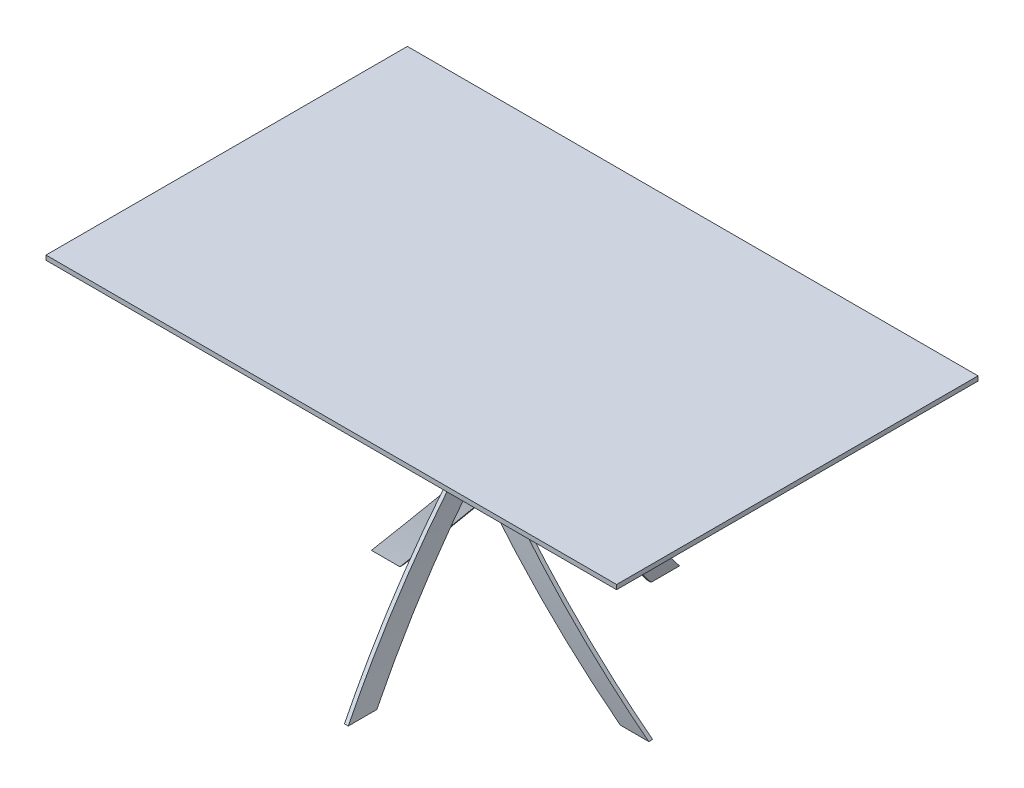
ISO-10303-21;
HEADER;
FILE_DESCRIPTION(('STEP AP214'),'2;1');
FILE_NAME('part.step','',(''),(''),'','','');
FILE_SCHEMA(('AUTOMOTIVE_DESIGN { 1 0 10303 214 1 1 1 1 }'));
ENDSEC;
DATA;
#1=APPLICATION_CONTEXT('core data for automotive mechanical design processes');
#2=APPLICATION_PROTOCOL_DEFINITION('international standard','automotive_design',2000,#1);
#3=PRODUCT_CONTEXT('',#1,'mechanical');
#4=PRODUCT('Part','Part','',(#3));
#5=PRODUCT_RELATED_PRODUCT_CATEGORY('part','',(#4));
#6=PRODUCT_DEFINITION_FORMATION('','',#4);
#7=PRODUCT_DEFINITION_CONTEXT('part definition',#1,'design');
#8=PRODUCT_DEFINITION('design','',#6,#7);
#9=PRODUCT_DEFINITION_SHAPE('','',#8);
#10=(LENGTH_UNIT() NAMED_UNIT(*) SI_UNIT(.MILLI.,.METRE.));
#11=(NAMED_UNIT(*) PLANE_ANGLE_UNIT() SI_UNIT($,.RADIAN.));
#12=(NAMED_UNIT(*) SI_UNIT($,.STERADIAN.) SOLID_ANGLE_UNIT());
#13=UNCERTAINTY_MEASURE_WITH_UNIT(LENGTH_MEASURE(1.E-05),#10,'distance_accuracy_value','');
#14=(GEOMETRIC_REPRESENTATION_CONTEXT(3) GLOBAL_UNCERTAINTY_ASSIGNED_CONTEXT((#13)) GLOBAL_UNIT_ASSIGNED_CONTEXT((#10,
#11,#12)) REPRESENTATION_CONTEXT('',''));
#15=CARTESIAN_POINT('',(0.,0.,0.));
#16=DIRECTION('',(0.,0.,1.));
#17=DIRECTION('',(1.,0.,0.));
#18=AXIS2_PLACEMENT_3D('',#15,#16,#17);
#19=CARTESIAN_POINT('',(1721.56180703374,370.,500.000000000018));
#20=DIRECTION('',(0.,0.,-1.));
#21=DIRECTION('',(-1.,0.,0.));
#22=AXIS2_PLACEMENT_3D('',#19,#20,#21);
#23=CYLINDRICAL_SURFACE('',#22,1800.);
#24=DIRECTION('',(0.,0.,-1.));
#25=VECTOR('',#24,1.);
#26=CARTESIAN_POINT('',(-40.4188966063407,1.99999999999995,499.999999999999));
#27=LINE('',#26,#25);
#28=CARTESIAN_POINT('',(-40.4188966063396,1.99999999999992,399.994999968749));
#29=VERTEX_POINT('',#28);
#30=CARTESIAN_POINT('',(-40.418896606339,1.99999999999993,324.994999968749));
#31=VERTEX_POINT('',#30);
#32=EDGE_CURVE('E70',#29,#31,#27,.T.);
#33=ORIENTED_EDGE('',*,*,#32,.F.);
#34=CARTESIAN_POINT('',(1721.56180703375,370.,100.808008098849));
#35=DIRECTION('',(0.,0.63083008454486,0.775921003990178));
#36=DIRECTION('',(0.,0.775921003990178,-0.63083008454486));
#37=AXIS2_PLACEMENT_3D('',#34,#35,#36);
#38=ELLIPSE('',#37,2319.82378456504,1800.);
#39=CARTESIAN_POINT('',(-39.9999999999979,740.,-200.005000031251));
#40=VERTEX_POINT('',#39);
#41=EDGE_CURVE('E90',#40,#29,#38,.T.);
#42=ORIENTED_EDGE('',*,*,#41,.F.);
#43=CARTESIAN_POINT('',(1721.56180703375,370.,-200.005000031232));
#44=DIRECTION('',(0.,0.,-1.));
#45=DIRECTION('',(-1.,0.,0.));
#46=AXIS2_PLACEMENT_3D('',#43,#44,#45);
#47=CIRCLE('',#46,1800.);
#48=CARTESIAN_POINT('',(-56.8799090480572,647.75,-200.005000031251));
#49=VERTEX_POINT('',#48);
#50=EDGE_CURVE('E87',#49,#40,#47,.T.);
#51=ORIENTED_EDGE('',*,*,#50,.F.);
#52=CARTESIAN_POINT('',(1721.56180703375,370.,25.808008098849));
#53=DIRECTION('',(0.,-0.63083008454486,-0.775921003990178));
#54=DIRECTION('',(0.,0.775921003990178,-0.63083008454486));
#55=AXIS2_PLACEMENT_3D('',#52,#53,#54);
#56=ELLIPSE('',#55,2319.82378456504,1800.);
#57=EDGE_CURVE('E50',#31,#49,#56,.T.);
#58=ORIENTED_EDGE('',*,*,#57,.F.);
#59=EDGE_LOOP('',(#33,#42,#51,#58));
#60=FACE_BOUND('',#59,.T.);
#61=ADVANCED_FACE('F46',(#60),#23,.T.);
#62=CARTESIAN_POINT('',(-300.000000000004,1.99999999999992,399.994999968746));
#63=DIRECTION('',(0.,0.63083008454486,0.775921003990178));
#64=DIRECTION('',(0.,-0.775921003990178,0.63083008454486));
#65=AXIS2_PLACEMENT_3D('',#62,#63,#64);
#66=PLANE('',#65);
#67=DIRECTION('',(1.,0.,0.));
#68=VECTOR('',#67,1.);
#69=CARTESIAN_POINT('',(-299.999999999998,740.,-200.005000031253));
#70=LINE('',#69,#68);
#71=CARTESIAN_POINT('',(-29.9999999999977,740.,-200.005000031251));
#72=VERTEX_POINT('',#71);
#73=EDGE_CURVE('E110',#40,#72,#70,.T.);
#74=ORIENTED_EDGE('',*,*,#73,.F.);
#75=ORIENTED_EDGE('',*,*,#41,.T.);
#76=DIRECTION('',(1.,0.,0.));
#77=VECTOR('',#76,1.);
#78=CARTESIAN_POINT('',(-300.000000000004,1.99999999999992,399.994999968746));
#79=LINE('',#78,#77);
#80=CARTESIAN_POINT('',(-30.4188966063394,1.99999999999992,399.994999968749));
#81=VERTEX_POINT('',#80);
#82=EDGE_CURVE('E104',#29,#81,#79,.T.);
#83=ORIENTED_EDGE('',*,*,#82,.T.);
#84=CARTESIAN_POINT('',(1731.56180703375,370.,100.808008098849));
#85=DIRECTION('',(0.,0.63083008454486,0.775921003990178));
#86=DIRECTION('',(0.,0.775921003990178,-0.63083008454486));
#87=AXIS2_PLACEMENT_3D('',#84,#85,#86);
#88=ELLIPSE('',#87,2319.82378456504,1800.);
#89=EDGE_CURVE('E95',#81,#72,#88,.F.);
#90=ORIENTED_EDGE('',*,*,#89,.T.);
#91=EDGE_LOOP('',(#74,#75,#83,#90));
#92=FACE_BOUND('',#91,.T.);
#93=ADVANCED_FACE('F119',(#92),#66,.T.);
#94=CARTESIAN_POINT('',(-299.999999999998,647.75,-200.005000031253));
#95=DIRECTION('',(0.,-0.63083008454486,-0.775921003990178));
#96=DIRECTION('',(0.,0.775921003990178,-0.63083008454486));
#97=AXIS2_PLACEMENT_3D('',#94,#95,#96);
#98=PLANE('',#97);
#99=DIRECTION('',(1.,0.,0.));
#100=VECTOR('',#99,1.);
#101=CARTESIAN_POINT('',(-300.000000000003,1.99999999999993,324.994999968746));
#102=LINE('',#101,#100);
#103=CARTESIAN_POINT('',(-30.4188966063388,1.99999999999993,324.994999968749));
#104=VERTEX_POINT('',#103);
#105=EDGE_CURVE('E12',#31,#104,#102,.T.);
#106=ORIENTED_EDGE('',*,*,#105,.F.);
#107=ORIENTED_EDGE('',*,*,#57,.T.);
#108=DIRECTION('',(1.,0.,0.));
#109=VECTOR('',#108,1.);
#110=CARTESIAN_POINT('',(-299.999999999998,647.75,-200.005000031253));
#111=LINE('',#110,#109);
#112=CARTESIAN_POINT('',(-46.879909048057,647.75,-200.005000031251));
#113=VERTEX_POINT('',#112);
#114=EDGE_CURVE('E55',#49,#113,#111,.T.);
#115=ORIENTED_EDGE('',*,*,#114,.T.);
#116=CARTESIAN_POINT('',(1731.56180703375,370.,25.8080080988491));
#117=DIRECTION('',(0.,-0.63083008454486,-0.775921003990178));
#118=DIRECTION('',(0.,0.775921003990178,-0.63083008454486));
#119=AXIS2_PLACEMENT_3D('',#116,#117,#118);
#120=ELLIPSE('',#119,2319.82378456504,1800.);
#121=EDGE_CURVE('E100',#113,#104,#120,.F.);
#122=ORIENTED_EDGE('',*,*,#121,.T.);
#123=EDGE_LOOP('',(#106,#107,#115,#122));
#124=FACE_BOUND('',#123,.T.);
#125=ADVANCED_FACE('F48',(#124),#98,.T.);
#126=CARTESIAN_POINT('',(-300.000000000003,1.99999999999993,324.994999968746));
#127=DIRECTION('',(0.,-1.,0.));
#128=DIRECTION('',(0.,0.,-1.));
#129=AXIS2_PLACEMENT_3D('',#126,#127,#128);
#130=PLANE('',#129);
#131=ORIENTED_EDGE('',*,*,#82,.F.);
#132=ORIENTED_EDGE('',*,*,#32,.T.);
#133=ORIENTED_EDGE('',*,*,#105,.T.);
#134=DIRECTION('',(0.,0.,-1.));
#135=VECTOR('',#134,1.);
#136=CARTESIAN_POINT('',(-30.4188966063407,1.99999999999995,500.));
#137=LINE('',#136,#135);
#138=EDGE_CURVE('E62',#104,#81,#137,.F.);
#139=ORIENTED_EDGE('',*,*,#138,.T.);
#140=EDGE_LOOP('',(#131,#132,#133,#139));
#141=FACE_BOUND('',#140,.T.);
#142=ADVANCED_FACE('F118',(#141),#130,.T.);
#143=CARTESIAN_POINT('',(-299.999999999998,740.,-200.005000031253));
#144=DIRECTION('',(0.,0.,-1.));
#145=DIRECTION('',(-1.,0.,0.));
#146=AXIS2_PLACEMENT_3D('',#143,#144,#145);
#147=PLANE('',#146);
#148=ORIENTED_EDGE('',*,*,#114,.F.);
#149=ORIENTED_EDGE('',*,*,#50,.T.);
#150=ORIENTED_EDGE('',*,*,#73,.T.);
#151=CARTESIAN_POINT('',(1731.56180703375,370.,-200.005000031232));
#152=DIRECTION('',(0.,0.,-1.));
#153=DIRECTION('',(-1.,0.,0.));
#154=AXIS2_PLACEMENT_3D('',#151,#152,#153);
#155=CIRCLE('',#154,1800.);
#156=EDGE_CURVE('E96',#72,#113,#155,.F.);
#157=ORIENTED_EDGE('',*,*,#156,.T.);
#158=EDGE_LOOP('',(#148,#149,#150,#157));
#159=FACE_BOUND('',#158,.T.);
#160=ADVANCED_FACE('F101',(#159),#147,.T.);
#161=CARTESIAN_POINT('',(1731.56180703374,370.,500.000000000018));
#162=DIRECTION('',(0.,0.,-1.));
#163=DIRECTION('',(-1.,0.,0.));
#164=AXIS2_PLACEMENT_3D('',#161,#162,#163);
#165=CYLINDRICAL_SURFACE('',#164,1800.);
#166=ORIENTED_EDGE('',*,*,#138,.F.);
#167=ORIENTED_EDGE('',*,*,#121,.F.);
#168=ORIENTED_EDGE('',*,*,#156,.F.);
#169=ORIENTED_EDGE('',*,*,#89,.F.);
#170=EDGE_LOOP('',(#166,#167,#168,#169));
#171=FACE_BOUND('',#170,.T.);
#172=ADVANCED_FACE('F122',(#171),#165,.F.);
#173=CLOSED_SHELL('',(#61,#93,#125,#142,#160,#172));
#174=MANIFOLD_SOLID_BREP('B2',#173);
#175=CARTESIAN_POINT('',(500.,370.,-1721.56180703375));
#176=DIRECTION('',(-1.,0.,0.));
#177=DIRECTION('',(0.,0.,1.));
#178=AXIS2_PLACEMENT_3D('',#175,#176,#177);
#179=CYLINDRICAL_SURFACE('',#178,1800.);
#180=DIRECTION('',(-1.,0.,0.));
#181=VECTOR('',#180,1.);
#182=CARTESIAN_POINT('',(500.,1.99999999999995,40.4188966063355));
#183=LINE('',#182,#181);
#184=CARTESIAN_POINT('',(399.99499996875,1.99999999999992,40.4188966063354));
#185=VERTEX_POINT('',#184);
#186=CARTESIAN_POINT('',(324.99499996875,1.99999999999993,40.4188966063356));
#187=VERTEX_POINT('',#186);
#188=EDGE_CURVE('E216',#185,#187,#183,.T.);
#189=ORIENTED_EDGE('',*,*,#188,.F.);
#190=CARTESIAN_POINT('',(100.808008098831,370.,-1721.56180703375));
#191=DIRECTION('',(0.775921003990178,0.63083008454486,0.));
#192=DIRECTION('',(-0.63083008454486,0.775921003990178,0.));
#193=AXIS2_PLACEMENT_3D('',#190,#191,#192);
#194=ELLIPSE('',#193,2319.82378456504,1800.);
#195=CARTESIAN_POINT('',(-200.00500003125,740.,40.));
#196=VERTEX_POINT('',#195);
#197=EDGE_CURVE('E236',#196,#185,#194,.T.);
#198=ORIENTED_EDGE('',*,*,#197,.F.);
#199=CARTESIAN_POINT('',(-200.00500003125,370.,-1721.56180703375));
#200=DIRECTION('',(-1.,0.,0.));
#201=DIRECTION('',(0.,0.,1.));
#202=AXIS2_PLACEMENT_3D('',#199,#200,#201);
#203=CIRCLE('',#202,1800.);
#204=CARTESIAN_POINT('',(-200.00500003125,647.75,56.8799090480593));
#205=VERTEX_POINT('',#204);
#206=EDGE_CURVE('E233',#205,#196,#203,.T.);
#207=ORIENTED_EDGE('',*,*,#206,.F.);
#208=CARTESIAN_POINT('',(25.808008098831,370.,-1721.56180703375));
#209=DIRECTION('',(-0.775921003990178,-0.63083008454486,0.));
#210=DIRECTION('',(-0.63083008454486,0.775921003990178,0.));
#211=AXIS2_PLACEMENT_3D('',#208,#209,#210);
#212=ELLIPSE('',#211,2319.82378456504,1800.);
#213=EDGE_CURVE('E196',#187,#205,#212,.T.);
#214=ORIENTED_EDGE('',*,*,#213,.F.);
#215=EDGE_LOOP('',(#189,#198,#207,#214));
#216=FACE_BOUND('',#215,.T.);
#217=ADVANCED_FACE('F192',(#216),#179,.T.);
#218=CARTESIAN_POINT('',(399.99499996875,1.99999999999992,300.));
#219=DIRECTION('',(0.775921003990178,0.63083008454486,0.));
#220=DIRECTION('',(0.63083008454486,-0.775921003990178,0.));
#221=AXIS2_PLACEMENT_3D('',#218,#219,#220);
#222=PLANE('',#221);
#223=DIRECTION('',(0.,0.,-1.));
#224=VECTOR('',#223,1.);
#225=CARTESIAN_POINT('',(-200.00500003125,740.,300.));
#226=LINE('',#225,#224);
#227=CARTESIAN_POINT('',(-200.00500003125,740.,29.9999999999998));
#228=VERTEX_POINT('',#227);
#229=EDGE_CURVE('E256',#196,#228,#226,.T.);
#230=ORIENTED_EDGE('',*,*,#229,.F.);
#231=ORIENTED_EDGE('',*,*,#197,.T.);
#232=DIRECTION('',(0.,0.,-1.));
#233=VECTOR('',#232,1.);
#234=CARTESIAN_POINT('',(399.99499996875,1.99999999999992,300.));
#235=LINE('',#234,#233);
#236=CARTESIAN_POINT('',(399.99499996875,1.99999999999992,30.4188966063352));
#237=VERTEX_POINT('',#236);
#238=EDGE_CURVE('E250',#185,#237,#235,.T.);
#239=ORIENTED_EDGE('',*,*,#238,.T.);
#240=CARTESIAN_POINT('',(100.808008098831,370.,-1731.56180703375));
#241=DIRECTION('',(0.775921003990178,0.63083008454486,0.));
#242=DIRECTION('',(-0.63083008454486,0.775921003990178,0.));
#243=AXIS2_PLACEMENT_3D('',#240,#241,#242);
#244=ELLIPSE('',#243,2319.82378456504,1800.);
#245=EDGE_CURVE('E241',#237,#228,#244,.F.);
#246=ORIENTED_EDGE('',*,*,#245,.T.);
#247=EDGE_LOOP('',(#230,#231,#239,#246));
#248=FACE_BOUND('',#247,.T.);
#249=ADVANCED_FACE('F265',(#248),#222,.T.);
#250=CARTESIAN_POINT('',(-200.00500003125,647.75,300.));
#251=DIRECTION('',(-0.775921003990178,-0.63083008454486,0.));
#252=DIRECTION('',(-0.63083008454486,0.775921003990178,0.));
#253=AXIS2_PLACEMENT_3D('',#250,#251,#252);
#254=PLANE('',#253);
#255=DIRECTION('',(0.,0.,-1.));
#256=VECTOR('',#255,1.);
#257=CARTESIAN_POINT('',(324.99499996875,1.99999999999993,300.));
#258=LINE('',#257,#256);
#259=CARTESIAN_POINT('',(324.99499996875,1.99999999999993,30.4188966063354));
#260=VERTEX_POINT('',#259);
#261=EDGE_CURVE('E44',#187,#260,#258,.T.);
#262=ORIENTED_EDGE('',*,*,#261,.F.);
#263=ORIENTED_EDGE('',*,*,#213,.T.);
#264=DIRECTION('',(0.,0.,-1.));
#265=VECTOR('',#264,1.);
#266=CARTESIAN_POINT('',(-200.00500003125,647.75,300.));
#267=LINE('',#266,#265);
#268=CARTESIAN_POINT('',(-200.00500003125,647.75,46.8799090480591));
#269=VERTEX_POINT('',#268);
#270=EDGE_CURVE('E201',#205,#269,#267,.T.);
#271=ORIENTED_EDGE('',*,*,#270,.T.);
#272=CARTESIAN_POINT('',(25.808008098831,370.,-1731.56180703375));
#273=DIRECTION('',(-0.775921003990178,-0.63083008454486,0.));
#274=DIRECTION('',(-0.63083008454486,0.775921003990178,0.));
#275=AXIS2_PLACEMENT_3D('',#272,#273,#274);
#276=ELLIPSE('',#275,2319.82378456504,1800.);
#277=EDGE_CURVE('E246',#269,#260,#276,.F.);
#278=ORIENTED_EDGE('',*,*,#277,.T.);
#279=EDGE_LOOP('',(#262,#263,#271,#278));
#280=FACE_BOUND('',#279,.T.);
#281=ADVANCED_FACE('F194',(#280),#254,.T.);
#282=CARTESIAN_POINT('',(324.99499996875,1.99999999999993,300.));
#283=DIRECTION('',(0.,-1.,0.));
#284=DIRECTION('',(-1.,0.,0.));
#285=AXIS2_PLACEMENT_3D('',#282,#283,#284);
#286=PLANE('',#285);
#287=ORIENTED_EDGE('',*,*,#238,.F.);
#288=ORIENTED_EDGE('',*,*,#188,.T.);
#289=ORIENTED_EDGE('',*,*,#261,.T.);
#290=DIRECTION('',(-1.,0.,0.));
#291=VECTOR('',#290,1.);
#292=CARTESIAN_POINT('',(500.,1.99999999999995,30.4188966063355));
#293=LINE('',#292,#291);
#294=EDGE_CURVE('E208',#260,#237,#293,.F.);
#295=ORIENTED_EDGE('',*,*,#294,.T.);
#296=EDGE_LOOP('',(#287,#288,#289,#295));
#297=FACE_BOUND('',#296,.T.);
#298=ADVANCED_FACE('F264',(#297),#286,.T.);
#299=CARTESIAN_POINT('',(-200.00500003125,740.,300.));
#300=DIRECTION('',(-1.,0.,0.));
#301=DIRECTION('',(0.,0.,1.));
#302=AXIS2_PLACEMENT_3D('',#299,#300,#301);
#303=PLANE('',#302);
#304=ORIENTED_EDGE('',*,*,#270,.F.);
#305=ORIENTED_EDGE('',*,*,#206,.T.);
#306=ORIENTED_EDGE('',*,*,#229,.T.);
#307=CARTESIAN_POINT('',(-200.00500003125,370.,-1731.56180703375));
#308=DIRECTION('',(-1.,0.,0.));
#309=DIRECTION('',(0.,0.,1.));
#310=AXIS2_PLACEMENT_3D('',#307,#308,#309);
#311=CIRCLE('',#310,1800.);
#312=EDGE_CURVE('E242',#228,#269,#311,.F.);
#313=ORIENTED_EDGE('',*,*,#312,.T.);
#314=EDGE_LOOP('',(#304,#305,#306,#313));
#315=FACE_BOUND('',#314,.T.);
#316=ADVANCED_FACE('F247',(#315),#303,.T.);
#317=CARTESIAN_POINT('',(500.,370.,-1731.56180703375));
#318=DIRECTION('',(-1.,0.,0.));
#319=DIRECTION('',(0.,0.,1.));
#320=AXIS2_PLACEMENT_3D('',#317,#318,#319);
#321=CYLINDRICAL_SURFACE('',#320,1800.);
#322=ORIENTED_EDGE('',*,*,#294,.F.);
#323=ORIENTED_EDGE('',*,*,#277,.F.);
#324=ORIENTED_EDGE('',*,*,#312,.F.);
#325=ORIENTED_EDGE('',*,*,#245,.F.);
#326=EDGE_LOOP('',(#322,#323,#324,#325));
#327=FACE_BOUND('',#326,.T.);
#328=ADVANCED_FACE('F268',(#327),#321,.F.);
#329=CLOSED_SHELL('',(#217,#249,#281,#298,#316,#328));
#330=MANIFOLD_SOLID_BREP('B6',#329);
#331=CARTESIAN_POINT('',(-1721.56180703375,370.,-500.000000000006));
#332=DIRECTION('',(0.,0.,1.));
#333=DIRECTION('',(1.,0.,0.));
#334=AXIS2_PLACEMENT_3D('',#331,#332,#333);
#335=CYLINDRICAL_SURFACE('',#334,1800.);
#336=DIRECTION('',(0.,0.,1.));
#337=VECTOR('',#336,1.);
#338=CARTESIAN_POINT('',(40.4188966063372,1.99999999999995,-500.));
#339=LINE('',#338,#337);
#340=CARTESIAN_POINT('',(40.4188966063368,1.99999999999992,-399.994999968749));
#341=VERTEX_POINT('',#340);
#342=CARTESIAN_POINT('',(40.4188966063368,1.99999999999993,-324.994999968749));
#343=VERTEX_POINT('',#342);
#344=EDGE_CURVE('E362',#341,#343,#339,.T.);
#345=ORIENTED_EDGE('',*,*,#344,.F.);
#346=CARTESIAN_POINT('',(-1721.56180703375,370.,-100.808008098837));
#347=DIRECTION('',(0.,0.63083008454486,-0.775921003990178));
#348=DIRECTION('',(0.,0.775921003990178,0.63083008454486));
#349=AXIS2_PLACEMENT_3D('',#346,#347,#348);
#350=ELLIPSE('',#349,2319.82378456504,1800.);
#351=CARTESIAN_POINT('',(39.9999999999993,740.,200.00500003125));
#352=VERTEX_POINT('',#351);
#353=EDGE_CURVE('E382',#352,#341,#350,.T.);
#354=ORIENTED_EDGE('',*,*,#353,.F.);
#355=CARTESIAN_POINT('',(-1721.56180703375,370.,200.005000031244));
#356=DIRECTION('',(0.,0.,1.));
#357=DIRECTION('',(1.,0.,0.));
#358=AXIS2_PLACEMENT_3D('',#355,#356,#357);
#359=CIRCLE('',#358,1800.);
#360=CARTESIAN_POINT('',(56.8799090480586,647.75,200.00500003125));
#361=VERTEX_POINT('',#360);
#362=EDGE_CURVE('E379',#361,#352,#359,.T.);
#363=ORIENTED_EDGE('',*,*,#362,.F.);
#364=CARTESIAN_POINT('',(-1721.56180703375,370.,-25.808008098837));
#365=DIRECTION('',(0.,-0.63083008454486,0.775921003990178));
#366=DIRECTION('',(0.,0.775921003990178,0.63083008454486));
#367=AXIS2_PLACEMENT_3D('',#364,#365,#366);
#368=ELLIPSE('',#367,2319.82378456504,1800.);
#369=EDGE_CURVE('E342',#343,#361,#368,.T.);
#370=ORIENTED_EDGE('',*,*,#369,.F.);
#371=EDGE_LOOP('',(#345,#354,#363,#370));
#372=FACE_BOUND('',#371,.T.);
#373=ADVANCED_FACE('F338',(#372),#335,.T.);
#374=CARTESIAN_POINT('',(300.000000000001,1.99999999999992,-399.994999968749));
#375=DIRECTION('',(0.,0.63083008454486,-0.775921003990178));
#376=DIRECTION('',(0.,-0.775921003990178,-0.63083008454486));
#377=AXIS2_PLACEMENT_3D('',#374,#375,#376);
#378=PLANE('',#377);
#379=DIRECTION('',(-1.,0.,0.));
#380=VECTOR('',#379,1.);
#381=CARTESIAN_POINT('',(299.999999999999,740.,200.005000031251));
#382=LINE('',#381,#380);
#383=CARTESIAN_POINT('',(29.9999999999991,740.,200.00500003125));
#384=VERTEX_POINT('',#383);
#385=EDGE_CURVE('E402',#352,#384,#382,.T.);
#386=ORIENTED_EDGE('',*,*,#385,.F.);
#387=ORIENTED_EDGE('',*,*,#353,.T.);
#388=DIRECTION('',(-1.,0.,0.));
#389=VECTOR('',#388,1.);
#390=CARTESIAN_POINT('',(300.000000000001,1.99999999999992,-399.994999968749));
#391=LINE('',#390,#389);
#392=CARTESIAN_POINT('',(30.4188966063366,1.99999999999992,-399.99499996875));
#393=VERTEX_POINT('',#392);
#394=EDGE_CURVE('E396',#341,#393,#391,.T.);
#395=ORIENTED_EDGE('',*,*,#394,.T.);
#396=CARTESIAN_POINT('',(-1731.56180703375,370.,-100.808008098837));
#397=DIRECTION('',(0.,0.63083008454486,-0.775921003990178));
#398=DIRECTION('',(0.,0.775921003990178,0.63083008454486));
#399=AXIS2_PLACEMENT_3D('',#396,#397,#398);
#400=ELLIPSE('',#399,2319.82378456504,1800.);
#401=EDGE_CURVE('E387',#393,#384,#400,.F.);
#402=ORIENTED_EDGE('',*,*,#401,.T.);
#403=EDGE_LOOP('',(#386,#387,#395,#402));
#404=FACE_BOUND('',#403,.T.);
#405=ADVANCED_FACE('F411',(#404),#378,.T.);
#406=CARTESIAN_POINT('',(299.999999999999,647.75,200.005000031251));
#407=DIRECTION('',(0.,-0.63083008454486,0.775921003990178));
#408=DIRECTION('',(0.,0.775921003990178,0.63083008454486));
#409=AXIS2_PLACEMENT_3D('',#406,#407,#408);
#410=PLANE('',#409);
#411=DIRECTION('',(-1.,0.,0.));
#412=VECTOR('',#411,1.);
#413=CARTESIAN_POINT('',(300.000000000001,1.99999999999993,-324.994999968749));
#414=LINE('',#413,#412);
#415=CARTESIAN_POINT('',(30.4188966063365,1.99999999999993,-324.99499996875));
#416=VERTEX_POINT('',#415);
#417=EDGE_CURVE('E190',#343,#416,#414,.T.);
#418=ORIENTED_EDGE('',*,*,#417,.F.);
#419=ORIENTED_EDGE('',*,*,#369,.T.);
#420=DIRECTION('',(-1.,0.,0.));
#421=VECTOR('',#420,1.);
#422=CARTESIAN_POINT('',(299.999999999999,647.75,200.005000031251));
#423=LINE('',#422,#421);
#424=CARTESIAN_POINT('',(46.8799090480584,647.75,200.00500003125));
#425=VERTEX_POINT('',#424);
#426=EDGE_CURVE('E347',#361,#425,#423,.T.);
#427=ORIENTED_EDGE('',*,*,#426,.T.);
#428=CARTESIAN_POINT('',(-1731.56180703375,370.,-25.808008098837));
#429=DIRECTION('',(0.,-0.63083008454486,0.775921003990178));
#430=DIRECTION('',(0.,0.775921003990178,0.63083008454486));
#431=AXIS2_PLACEMENT_3D('',#428,#429,#430);
#432=ELLIPSE('',#431,2319.82378456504,1800.);
#433=EDGE_CURVE('E392',#425,#416,#432,.F.);
#434=ORIENTED_EDGE('',*,*,#433,.T.);
#435=EDGE_LOOP('',(#418,#419,#427,#434));
#436=FACE_BOUND('',#435,.T.);
#437=ADVANCED_FACE('F340',(#436),#410,.T.);
#438=CARTESIAN_POINT('',(300.000000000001,1.99999999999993,-324.994999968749));
#439=DIRECTION('',(0.,-1.,0.));
#440=DIRECTION('',(0.,0.,1.));
#441=AXIS2_PLACEMENT_3D('',#438,#439,#440);
#442=PLANE('',#441);
#443=ORIENTED_EDGE('',*,*,#394,.F.);
#444=ORIENTED_EDGE('',*,*,#344,.T.);
#445=ORIENTED_EDGE('',*,*,#417,.T.);
#446=DIRECTION('',(0.,0.,1.));
#447=VECTOR('',#446,1.);
#448=CARTESIAN_POINT('',(30.4188966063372,1.99999999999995,-500.));
#449=LINE('',#448,#447);
#450=EDGE_CURVE('E354',#416,#393,#449,.F.);
#451=ORIENTED_EDGE('',*,*,#450,.T.);
#452=EDGE_LOOP('',(#443,#444,#445,#451));
#453=FACE_BOUND('',#452,.T.);
#454=ADVANCED_FACE('F410',(#453),#442,.T.);
#455=CARTESIAN_POINT('',(299.999999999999,740.,200.005000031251));
#456=DIRECTION('',(0.,0.,1.));
#457=DIRECTION('',(1.,0.,0.));
#458=AXIS2_PLACEMENT_3D('',#455,#456,#457);
#459=PLANE('',#458);
#460=ORIENTED_EDGE('',*,*,#426,.F.);
#461=ORIENTED_EDGE('',*,*,#362,.T.);
#462=ORIENTED_EDGE('',*,*,#385,.T.);
#463=CARTESIAN_POINT('',(-1731.56180703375,370.,200.005000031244));
#464=DIRECTION('',(0.,0.,1.));
#465=DIRECTION('',(1.,0.,0.));
#466=AXIS2_PLACEMENT_3D('',#463,#464,#465);
#467=CIRCLE('',#466,1800.);
#468=EDGE_CURVE('E388',#384,#425,#467,.F.);
#469=ORIENTED_EDGE('',*,*,#468,.T.);
#470=EDGE_LOOP('',(#460,#461,#462,#469));
#471=FACE_BOUND('',#470,.T.);
#472=ADVANCED_FACE('F393',(#471),#459,.T.);
#473=CARTESIAN_POINT('',(-1731.56180703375,370.,-500.000000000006));
#474=DIRECTION('',(0.,0.,1.));
#475=DIRECTION('',(1.,0.,0.));
#476=AXIS2_PLACEMENT_3D('',#473,#474,#475);
#477=CYLINDRICAL_SURFACE('',#476,1800.);
#478=ORIENTED_EDGE('',*,*,#450,.F.);
#479=ORIENTED_EDGE('',*,*,#433,.F.);
#480=ORIENTED_EDGE('',*,*,#468,.F.);
#481=ORIENTED_EDGE('',*,*,#401,.F.);
#482=EDGE_LOOP('',(#478,#479,#480,#481));
#483=FACE_BOUND('',#482,.T.);
#484=ADVANCED_FACE('F414',(#483),#477,.F.);
#485=CLOSED_SHELL('',(#373,#405,#437,#454,#472,#484));
#486=MANIFOLD_SOLID_BREP('B38',#485);
#487=CARTESIAN_POINT('',(-500.,370.,1721.56180703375));
#488=DIRECTION('',(1.,0.,0.));
#489=DIRECTION('',(0.,0.,-1.));
#490=AXIS2_PLACEMENT_3D('',#487,#488,#489);
#491=CYLINDRICAL_SURFACE('',#490,1800.);
#492=DIRECTION('',(1.,0.,0.));
#493=VECTOR('',#492,1.);
#494=CARTESIAN_POINT('',(-500.,1.99999999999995,-40.4188966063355));
#495=LINE('',#494,#493);
#496=CARTESIAN_POINT('',(-399.99499996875,1.99999999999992,-40.4188966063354));
#497=VERTEX_POINT('',#496);
#498=CARTESIAN_POINT('',(-324.99499996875,1.99999999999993,-40.4188966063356));
#499=VERTEX_POINT('',#498);
#500=EDGE_CURVE('E507',#497,#499,#495,.T.);
#501=ORIENTED_EDGE('',*,*,#500,.F.);
#502=CARTESIAN_POINT('',(-100.808008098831,370.,1721.56180703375));
#503=DIRECTION('',(-0.775921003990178,0.63083008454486,0.));
#504=DIRECTION('',(0.63083008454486,0.775921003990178,0.));
#505=AXIS2_PLACEMENT_3D('',#502,#503,#504);
#506=ELLIPSE('',#505,2319.82378456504,1800.);
#507=CARTESIAN_POINT('',(200.00500003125,740.,-40.));
#508=VERTEX_POINT('',#507);
#509=EDGE_CURVE('E527',#508,#497,#506,.T.);
#510=ORIENTED_EDGE('',*,*,#509,.F.);
#511=CARTESIAN_POINT('',(200.00500003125,370.,1721.56180703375));
#512=DIRECTION('',(1.,0.,0.));
#513=DIRECTION('',(0.,0.,-1.));
#514=AXIS2_PLACEMENT_3D('',#511,#512,#513);
#515=CIRCLE('',#514,1800.);
#516=CARTESIAN_POINT('',(200.00500003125,647.75,-56.8799090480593));
#517=VERTEX_POINT('',#516);
#518=EDGE_CURVE('E524',#517,#508,#515,.T.);
#519=ORIENTED_EDGE('',*,*,#518,.F.);
#520=CARTESIAN_POINT('',(-25.808008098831,370.,1721.56180703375));
#521=DIRECTION('',(0.775921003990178,-0.63083008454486,0.));
#522=DIRECTION('',(0.63083008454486,0.775921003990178,0.));
#523=AXIS2_PLACEMENT_3D('',#520,#521,#522);
#524=ELLIPSE('',#523,2319.82378456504,1800.);
#525=EDGE_CURVE('E487',#499,#517,#524,.T.);
#526=ORIENTED_EDGE('',*,*,#525,.F.);
#527=EDGE_LOOP('',(#501,#510,#519,#526));
#528=FACE_BOUND('',#527,.T.);
#529=ADVANCED_FACE('F483',(#528),#491,.T.);
#530=CARTESIAN_POINT('',(-399.99499996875,1.99999999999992,-300.));
#531=DIRECTION('',(-0.775921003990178,0.63083008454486,0.));
#532=DIRECTION('',(-0.63083008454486,-0.775921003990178,0.));
#533=AXIS2_PLACEMENT_3D('',#530,#531,#532);
#534=PLANE('',#533);
#535=DIRECTION('',(0.,0.,1.));
#536=VECTOR('',#535,1.);
#537=CARTESIAN_POINT('',(200.00500003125,740.,-300.));
#538=LINE('',#537,#536);
#539=CARTESIAN_POINT('',(200.00500003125,740.,-29.9999999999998));
#540=VERTEX_POINT('',#539);
#541=EDGE_CURVE('E547',#508,#540,#538,.T.);
#542=ORIENTED_EDGE('',*,*,#541,.F.);
#543=ORIENTED_EDGE('',*,*,#509,.T.);
#544=DIRECTION('',(0.,0.,1.));
#545=VECTOR('',#544,1.);
#546=CARTESIAN_POINT('',(-399.99499996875,1.99999999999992,-300.));
#547=LINE('',#546,#545);
#548=CARTESIAN_POINT('',(-399.99499996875,1.99999999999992,-30.4188966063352));
#549=VERTEX_POINT('',#548);
#550=EDGE_CURVE('E541',#497,#549,#547,.T.);
#551=ORIENTED_EDGE('',*,*,#550,.T.);
#552=CARTESIAN_POINT('',(-100.808008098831,370.,1731.56180703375));
#553=DIRECTION('',(-0.775921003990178,0.63083008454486,0.));
#554=DIRECTION('',(0.63083008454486,0.775921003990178,0.));
#555=AXIS2_PLACEMENT_3D('',#552,#553,#554);
#556=ELLIPSE('',#555,2319.82378456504,1800.);
#557=EDGE_CURVE('E532',#549,#540,#556,.F.);
#558=ORIENTED_EDGE('',*,*,#557,.T.);
#559=EDGE_LOOP('',(#542,#543,#551,#558));
#560=FACE_BOUND('',#559,.T.);
#561=ADVANCED_FACE('F556',(#560),#534,.T.);
#562=CARTESIAN_POINT('',(200.00500003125,647.75,-300.));
#563=DIRECTION('',(0.775921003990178,-0.63083008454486,0.));
#564=DIRECTION('',(0.63083008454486,0.775921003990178,0.));
#565=AXIS2_PLACEMENT_3D('',#562,#563,#564);
#566=PLANE('',#565);
#567=DIRECTION('',(0.,0.,1.));
#568=VECTOR('',#567,1.);
#569=CARTESIAN_POINT('',(-324.99499996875,1.99999999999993,-300.));
#570=LINE('',#569,#568);
#571=CARTESIAN_POINT('',(-324.99499996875,1.99999999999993,-30.4188966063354));
#572=VERTEX_POINT('',#571);
#573=EDGE_CURVE('E336',#499,#572,#570,.T.);
#574=ORIENTED_EDGE('',*,*,#573,.F.);
#575=ORIENTED_EDGE('',*,*,#525,.T.);
#576=DIRECTION('',(0.,0.,1.));
#577=VECTOR('',#576,1.);
#578=CARTESIAN_POINT('',(200.00500003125,647.75,-300.));
#579=LINE('',#578,#577);
#580=CARTESIAN_POINT('',(200.00500003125,647.75,-46.8799090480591));
#581=VERTEX_POINT('',#580);
#582=EDGE_CURVE('E492',#517,#581,#579,.T.);
#583=ORIENTED_EDGE('',*,*,#582,.T.);
#584=CARTESIAN_POINT('',(-25.808008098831,370.,1731.56180703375));
#585=DIRECTION('',(0.775921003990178,-0.63083008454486,0.));
#586=DIRECTION('',(0.63083008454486,0.775921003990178,0.));
#587=AXIS2_PLACEMENT_3D('',#584,#585,#586);
#588=ELLIPSE('',#587,2319.82378456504,1800.);
#589=EDGE_CURVE('E537',#581,#572,#588,.F.);
#590=ORIENTED_EDGE('',*,*,#589,.T.);
#591=EDGE_LOOP('',(#574,#575,#583,#590));
#592=FACE_BOUND('',#591,.T.);
#593=ADVANCED_FACE('F485',(#592),#566,.T.);
#594=CARTESIAN_POINT('',(-324.99499996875,1.99999999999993,-300.));
#595=DIRECTION('',(0.,-1.,0.));
#596=DIRECTION('',(1.,0.,0.));
#597=AXIS2_PLACEMENT_3D('',#594,#595,#596);
#598=PLANE('',#597);
#599=ORIENTED_EDGE('',*,*,#550,.F.);
#600=ORIENTED_EDGE('',*,*,#500,.T.);
#601=ORIENTED_EDGE('',*,*,#573,.T.);
#602=DIRECTION('',(1.,0.,0.));
#603=VECTOR('',#602,1.);
#604=CARTESIAN_POINT('',(-500.,1.99999999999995,-30.4188966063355));
#605=LINE('',#604,#603);
#606=EDGE_CURVE('E499',#572,#549,#605,.F.);
#607=ORIENTED_EDGE('',*,*,#606,.T.);
#608=EDGE_LOOP('',(#599,#600,#601,#607));
#609=FACE_BOUND('',#608,.T.);
#610=ADVANCED_FACE('F555',(#609),#598,.T.);
#611=CARTESIAN_POINT('',(200.00500003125,740.,-300.));
#612=DIRECTION('',(1.,0.,0.));
#613=DIRECTION('',(0.,0.,-1.));
#614=AXIS2_PLACEMENT_3D('',#611,#612,#613);
#615=PLANE('',#614);
#616=ORIENTED_EDGE('',*,*,#582,.F.);
#617=ORIENTED_EDGE('',*,*,#518,.T.);
#618=ORIENTED_EDGE('',*,*,#541,.T.);
#619=CARTESIAN_POINT('',(200.00500003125,370.,1731.56180703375));
#620=DIRECTION('',(1.,0.,0.));
#621=DIRECTION('',(0.,0.,-1.));
#622=AXIS2_PLACEMENT_3D('',#619,#620,#621);
#623=CIRCLE('',#622,1800.);
#624=EDGE_CURVE('E533',#540,#581,#623,.F.);
#625=ORIENTED_EDGE('',*,*,#624,.T.);
#626=EDGE_LOOP('',(#616,#617,#618,#625));
#627=FACE_BOUND('',#626,.T.);
#628=ADVANCED_FACE('F538',(#627),#615,.T.);
#629=CARTESIAN_POINT('',(-500.,370.,1731.56180703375));
#630=DIRECTION('',(1.,0.,0.));
#631=DIRECTION('',(0.,0.,-1.));
#632=AXIS2_PLACEMENT_3D('',#629,#630,#631);
#633=CYLINDRICAL_SURFACE('',#632,1800.);
#634=ORIENTED_EDGE('',*,*,#606,.F.);
#635=ORIENTED_EDGE('',*,*,#589,.F.);
#636=ORIENTED_EDGE('',*,*,#624,.F.);
#637=ORIENTED_EDGE('',*,*,#557,.F.);
#638=EDGE_LOOP('',(#634,#635,#636,#637));
#639=FACE_BOUND('',#638,.T.);
#640=ADVANCED_FACE('F559',(#639),#633,.F.);
#641=CLOSED_SHELL('',(#529,#561,#593,#610,#628,#640));
#642=MANIFOLD_SOLID_BREP('B184',#641);
#643=CARTESIAN_POINT('',(750.,752.,-475.));
#644=DIRECTION('',(-1.,0.,0.));
#645=DIRECTION('',(0.,0.,1.));
#646=AXIS2_PLACEMENT_3D('',#643,#644,#645);
#647=PLANE('',#646);
#648=DIRECTION('',(0.,0.,-1.));
#649=VECTOR('',#648,1.);
#650=CARTESIAN_POINT('',(750.,740.,-475.));
#651=LINE('',#650,#649);
#652=CARTESIAN_POINT('',(750.,740.,475.));
#653=VERTEX_POINT('',#652);
#654=CARTESIAN_POINT('',(750.,740.,-475.));
#655=VERTEX_POINT('',#654);
#656=EDGE_CURVE('E670',#653,#655,#651,.T.);
#657=ORIENTED_EDGE('',*,*,#656,.T.);
#658=DIRECTION('',(0.,-1.,0.));
#659=VECTOR('',#658,1.);
#660=CARTESIAN_POINT('',(750.,752.,-475.));
#661=LINE('',#660,#659);
#662=CARTESIAN_POINT('',(750.,752.,-475.));
#663=VERTEX_POINT('',#662);
#664=EDGE_CURVE('E481',#663,#655,#661,.T.);
#665=ORIENTED_EDGE('',*,*,#664,.F.);
#666=DIRECTION('',(0.,0.,-1.));
#667=VECTOR('',#666,1.);
#668=CARTESIAN_POINT('',(750.,752.,-475.));
#669=LINE('',#668,#667);
#670=CARTESIAN_POINT('',(750.,752.,475.));
#671=VERTEX_POINT('',#670);
#672=EDGE_CURVE('E658',#671,#663,#669,.T.);
#673=ORIENTED_EDGE('',*,*,#672,.F.);
#674=DIRECTION('',(0.,-1.,0.));
#675=VECTOR('',#674,1.);
#676=CARTESIAN_POINT('',(750.,752.,475.));
#677=LINE('',#676,#675);
#678=EDGE_CURVE('E666',#671,#653,#677,.T.);
#679=ORIENTED_EDGE('',*,*,#678,.T.);
#680=EDGE_LOOP('',(#657,#665,#673,#679));
#681=FACE_BOUND('',#680,.T.);
#682=ADVANCED_FACE('F607',(#681),#647,.F.);
#683=CARTESIAN_POINT('',(-750.,752.,-475.));
#684=DIRECTION('',(0.,0.,1.));
#685=DIRECTION('',(1.,0.,0.));
#686=AXIS2_PLACEMENT_3D('',#683,#684,#685);
#687=PLANE('',#686);
#688=DIRECTION('',(-1.,0.,0.));
#689=VECTOR('',#688,1.);
#690=CARTESIAN_POINT('',(-750.,740.,-475.));
#691=LINE('',#690,#689);
#692=CARTESIAN_POINT('',(-750.,740.,-475.));
#693=VERTEX_POINT('',#692);
#694=EDGE_CURVE('E662',#655,#693,#691,.T.);
#695=ORIENTED_EDGE('',*,*,#694,.T.);
#696=DIRECTION('',(0.,-1.,0.));
#697=VECTOR('',#696,1.);
#698=CARTESIAN_POINT('',(-750.,752.,-475.));
#699=LINE('',#698,#697);
#700=CARTESIAN_POINT('',(-750.,752.,-475.));
#701=VERTEX_POINT('',#700);
#702=EDGE_CURVE('E615',#701,#693,#699,.T.);
#703=ORIENTED_EDGE('',*,*,#702,.F.);
#704=DIRECTION('',(-1.,0.,0.));
#705=VECTOR('',#704,1.);
#706=CARTESIAN_POINT('',(-750.,752.,-475.));
#707=LINE('',#706,#705);
#708=EDGE_CURVE('E653',#663,#701,#707,.T.);
#709=ORIENTED_EDGE('',*,*,#708,.F.);
#710=ORIENTED_EDGE('',*,*,#664,.T.);
#711=EDGE_LOOP('',(#695,#703,#709,#710));
#712=FACE_BOUND('',#711,.T.);
#713=ADVANCED_FACE('F661',(#712),#687,.F.);
#714=CARTESIAN_POINT('',(-750.,752.,-475.));
#715=DIRECTION('',(1.,0.,0.));
#716=DIRECTION('',(0.,0.,-1.));
#717=AXIS2_PLACEMENT_3D('',#714,#715,#716);
#718=PLANE('',#717);
#719=DIRECTION('',(0.,0.,1.));
#720=VECTOR('',#719,1.);
#721=CARTESIAN_POINT('',(-750.,740.,-475.));
#722=LINE('',#721,#720);
#723=CARTESIAN_POINT('',(-750.,740.,475.));
#724=VERTEX_POINT('',#723);
#725=EDGE_CURVE('E640',#693,#724,#722,.T.);
#726=ORIENTED_EDGE('',*,*,#725,.T.);
#727=DIRECTION('',(0.,-1.,0.));
#728=VECTOR('',#727,1.);
#729=CARTESIAN_POINT('',(-750.,752.,475.));
#730=LINE('',#729,#728);
#731=CARTESIAN_POINT('',(-750.,752.,475.));
#732=VERTEX_POINT('',#731);
#733=EDGE_CURVE('E663',#732,#724,#730,.T.);
#734=ORIENTED_EDGE('',*,*,#733,.F.);
#735=DIRECTION('',(0.,0.,1.));
#736=VECTOR('',#735,1.);
#737=CARTESIAN_POINT('',(-750.,752.,-475.));
#738=LINE('',#737,#736);
#739=EDGE_CURVE('E656',#701,#732,#738,.T.);
#740=ORIENTED_EDGE('',*,*,#739,.F.);
#741=ORIENTED_EDGE('',*,*,#702,.T.);
#742=EDGE_LOOP('',(#726,#734,#740,#741));
#743=FACE_BOUND('',#742,.T.);
#744=ADVANCED_FACE('F664',(#743),#718,.F.);
#745=CARTESIAN_POINT('',(-750.,752.,475.));
#746=DIRECTION('',(0.,0.,-1.));
#747=DIRECTION('',(-1.,0.,0.));
#748=AXIS2_PLACEMENT_3D('',#745,#746,#747);
#749=PLANE('',#748);
#750=DIRECTION('',(1.,0.,0.));
#751=VECTOR('',#750,1.);
#752=CARTESIAN_POINT('',(-750.,740.,475.));
#753=LINE('',#752,#751);
#754=EDGE_CURVE('E646',#724,#653,#753,.T.);
#755=ORIENTED_EDGE('',*,*,#754,.T.);
#756=ORIENTED_EDGE('',*,*,#678,.F.);
#757=DIRECTION('',(1.,0.,0.));
#758=VECTOR('',#757,1.);
#759=CARTESIAN_POINT('',(-750.,752.,475.));
#760=LINE('',#759,#758);
#761=EDGE_CURVE('E623',#732,#671,#760,.T.);
#762=ORIENTED_EDGE('',*,*,#761,.F.);
#763=ORIENTED_EDGE('',*,*,#733,.T.);
#764=EDGE_LOOP('',(#755,#756,#762,#763));
#765=FACE_BOUND('',#764,.T.);
#766=ADVANCED_FACE('F677',(#765),#749,.F.);
#767=CARTESIAN_POINT('',(0.,752.,0.));
#768=DIRECTION('',(0.,1.,0.));
#769=DIRECTION('',(0.,0.,1.));
#770=AXIS2_PLACEMENT_3D('',#767,#768,#769);
#771=PLANE('',#770);
#772=ORIENTED_EDGE('',*,*,#672,.T.);
#773=ORIENTED_EDGE('',*,*,#708,.T.);
#774=ORIENTED_EDGE('',*,*,#739,.T.);
#775=ORIENTED_EDGE('',*,*,#761,.T.);
#776=EDGE_LOOP('',(#772,#773,#774,#775));
#777=FACE_BOUND('',#776,.T.);
#778=ADVANCED_FACE('F654',(#777),#771,.T.);
#779=CARTESIAN_POINT('',(0.,740.,0.));
#780=DIRECTION('',(0.,1.,0.));
#781=DIRECTION('',(0.,0.,1.));
#782=AXIS2_PLACEMENT_3D('',#779,#780,#781);
#783=PLANE('',#782);
#784=ORIENTED_EDGE('',*,*,#656,.F.);
#785=ORIENTED_EDGE('',*,*,#754,.F.);
#786=ORIENTED_EDGE('',*,*,#725,.F.);
#787=ORIENTED_EDGE('',*,*,#694,.F.);
#788=EDGE_LOOP('',(#784,#785,#786,#787));
#789=FACE_BOUND('',#788,.T.);
#790=ADVANCED_FACE('F680',(#789),#783,.F.);
#791=CLOSED_SHELL('',(#682,#713,#744,#766,#778,#790));
#792=MANIFOLD_SOLID_BREP('B330',#791);
#793=ADVANCED_BREP_SHAPE_REPRESENTATION('',(#18,#174,#330,#486,#642,#792),#14);
#794=SHAPE_DEFINITION_REPRESENTATION(#9,#793);
ENDSEC;
END-ISO-10303-21;
